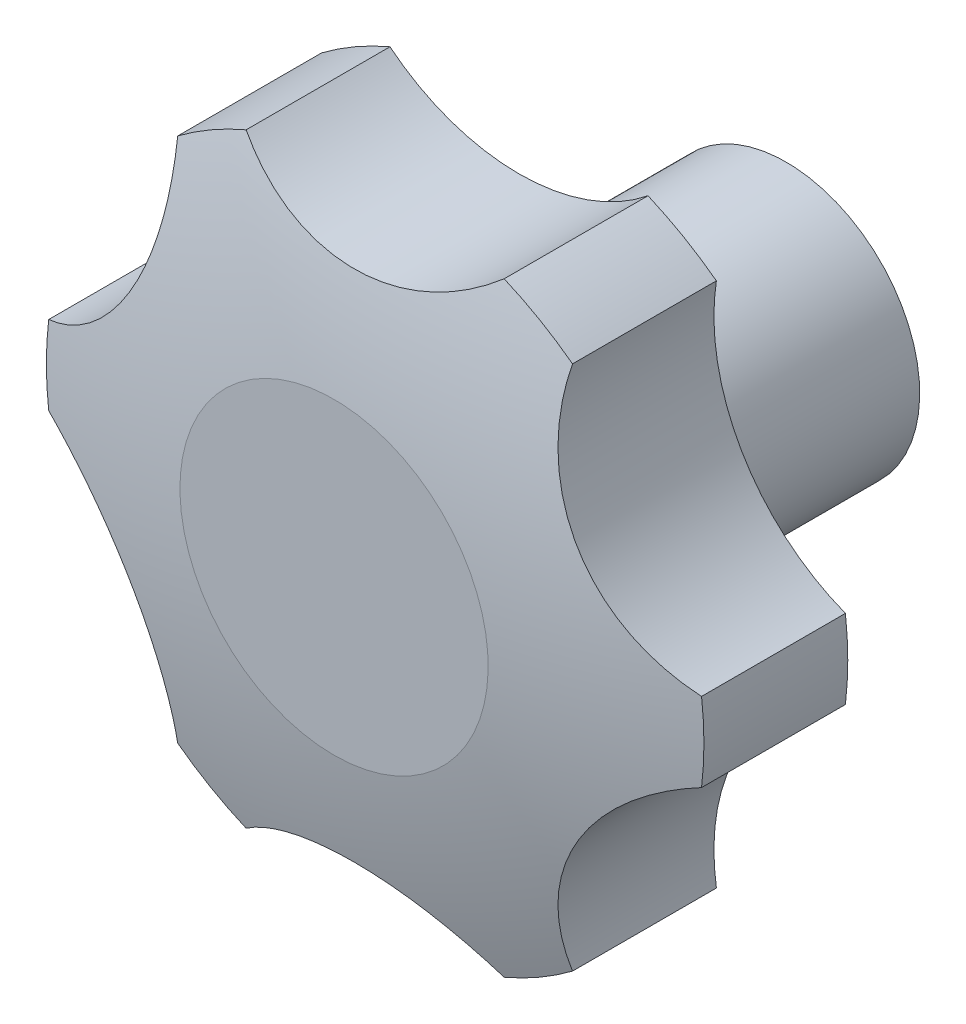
ISO-10303-21;
HEADER;
FILE_DESCRIPTION(('STEP AP214'),'2;1');
FILE_NAME('part.step','',(''),(''),'','','');
FILE_SCHEMA(('AUTOMOTIVE_DESIGN { 1 0 10303 214 1 1 1 1 }'));
ENDSEC;
DATA;
#1=APPLICATION_CONTEXT('core data for automotive mechanical design processes');
#2=APPLICATION_PROTOCOL_DEFINITION('international standard','automotive_design',2000,#1);
#3=PRODUCT_CONTEXT('',#1,'mechanical');
#4=PRODUCT('Part','Part','',(#3));
#5=PRODUCT_RELATED_PRODUCT_CATEGORY('part','',(#4));
#6=PRODUCT_DEFINITION_FORMATION('','',#4);
#7=PRODUCT_DEFINITION_CONTEXT('part definition',#1,'design');
#8=PRODUCT_DEFINITION('design','',#6,#7);
#9=PRODUCT_DEFINITION_SHAPE('','',#8);
#10=(LENGTH_UNIT() NAMED_UNIT(*) SI_UNIT(.MILLI.,.METRE.));
#11=(NAMED_UNIT(*) PLANE_ANGLE_UNIT() SI_UNIT($,.RADIAN.));
#12=(NAMED_UNIT(*) SI_UNIT($,.STERADIAN.) SOLID_ANGLE_UNIT());
#13=UNCERTAINTY_MEASURE_WITH_UNIT(LENGTH_MEASURE(1.E-05),#10,'distance_accuracy_value','');
#14=(GEOMETRIC_REPRESENTATION_CONTEXT(3) GLOBAL_UNCERTAINTY_ASSIGNED_CONTEXT((#13)) GLOBAL_UNIT_ASSIGNED_CONTEXT((#10,
#11,#12)) REPRESENTATION_CONTEXT('',''));
#15=CARTESIAN_POINT('',(0.,0.,0.));
#16=DIRECTION('',(0.,0.,1.));
#17=DIRECTION('',(1.,0.,0.));
#18=AXIS2_PLACEMENT_3D('',#15,#16,#17);
#19=CARTESIAN_POINT('',(0.,0.,30.));
#20=DIRECTION('',(0.,0.,1.));
#21=DIRECTION('',(0.,-1.,0.));
#22=AXIS2_PLACEMENT_3D('',#19,#20,#21);
#23=CYLINDRICAL_SURFACE('',#22,16.);
#24=DIRECTION('',(0.,0.,1.));
#25=VECTOR('',#24,1.);
#26=CARTESIAN_POINT('',(15.8842635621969,-1.92098180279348,16.5));
#27=LINE('',#26,#25);
#28=CARTESIAN_POINT('',(15.8842635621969,-1.92098180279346,13.));
#29=VERTEX_POINT('',#28);
#30=CARTESIAN_POINT('',(15.884263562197,-1.92098180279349,20.));
#31=VERTEX_POINT('',#30);
#32=EDGE_CURVE('E35',#29,#31,#27,.T.);
#33=ORIENTED_EDGE('',*,*,#32,.F.);
#34=CARTESIAN_POINT('',(0.,0.,13.));
#35=DIRECTION('',(0.,0.,1.));
#36=DIRECTION('',(0.,-1.,0.));
#37=AXIS2_PLACEMENT_3D('',#34,#35,#36);
#38=CIRCLE('',#37,16.);
#39=CARTESIAN_POINT('',(15.884263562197,1.92098180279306,13.));
#40=VERTEX_POINT('',#39);
#41=EDGE_CURVE('E120',#29,#40,#38,.T.);
#42=ORIENTED_EDGE('',*,*,#41,.T.);
#43=DIRECTION('',(0.,0.,1.));
#44=VECTOR('',#43,1.);
#45=CARTESIAN_POINT('',(15.884263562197,1.92098180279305,17.5));
#46=LINE('',#45,#44);
#47=CARTESIAN_POINT('',(15.884263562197,1.92098180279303,20.));
#48=VERTEX_POINT('',#47);
#49=EDGE_CURVE('E261',#48,#40,#46,.F.);
#50=ORIENTED_EDGE('',*,*,#49,.F.);
#51=CARTESIAN_POINT('',(0.,0.,20.));
#52=DIRECTION('',(0.,0.,1.));
#53=DIRECTION('',(0.,-1.,0.));
#54=AXIS2_PLACEMENT_3D('',#51,#52,#53);
#55=CIRCLE('',#54,16.);
#56=EDGE_CURVE('E122',#31,#48,#55,.T.);
#57=ORIENTED_EDGE('',*,*,#56,.F.);
#58=EDGE_LOOP('',(#33,#42,#50,#57));
#59=FACE_BOUND('',#58,.T.);
#60=ADVANCED_FACE('F14',(#59),#23,.T.);
#61=DIRECTION('',(0.,0.,1.));
#62=VECTOR('',#61,1.);
#63=CARTESIAN_POINT('',(9.60575082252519,12.7956848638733,17.5));
#64=LINE('',#63,#62);
#65=CARTESIAN_POINT('',(9.60575082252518,12.7956848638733,13.));
#66=VERTEX_POINT('',#65);
#67=CARTESIAN_POINT('',(9.60575082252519,12.7956848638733,20.));
#68=VERTEX_POINT('',#67);
#69=EDGE_CURVE('E42',#66,#68,#64,.T.);
#70=ORIENTED_EDGE('',*,*,#69,.F.);
#71=CARTESIAN_POINT('',(6.27851273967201,14.7166666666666,13.));
#72=VERTEX_POINT('',#71);
#73=EDGE_CURVE('E130',#66,#72,#38,.T.);
#74=ORIENTED_EDGE('',*,*,#73,.T.);
#75=DIRECTION('',(0.,0.,1.));
#76=VECTOR('',#75,1.);
#77=CARTESIAN_POINT('',(6.27851273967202,14.7166666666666,17.5));
#78=LINE('',#77,#76);
#79=CARTESIAN_POINT('',(6.27851273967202,14.7166666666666,20.));
#80=VERTEX_POINT('',#79);
#81=EDGE_CURVE('E254',#80,#72,#78,.F.);
#82=ORIENTED_EDGE('',*,*,#81,.F.);
#83=EDGE_CURVE('E229',#68,#80,#55,.T.);
#84=ORIENTED_EDGE('',*,*,#83,.F.);
#85=EDGE_LOOP('',(#70,#74,#82,#84));
#86=FACE_BOUND('',#85,.T.);
#87=ADVANCED_FACE('F182',(#86),#23,.T.);
#88=DIRECTION('',(0.,0.,1.));
#89=VECTOR('',#88,1.);
#90=CARTESIAN_POINT('',(-6.27851273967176,14.7166666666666,17.5));
#91=LINE('',#90,#89);
#92=CARTESIAN_POINT('',(-6.27851273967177,14.7166666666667,13.));
#93=VERTEX_POINT('',#92);
#94=CARTESIAN_POINT('',(-6.27851273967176,14.7166666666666,20.));
#95=VERTEX_POINT('',#94);
#96=EDGE_CURVE('E252',#93,#95,#91,.T.);
#97=ORIENTED_EDGE('',*,*,#96,.F.);
#98=CARTESIAN_POINT('',(-9.60575082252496,12.7956848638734,13.));
#99=VERTEX_POINT('',#98);
#100=EDGE_CURVE('E134',#93,#99,#38,.T.);
#101=ORIENTED_EDGE('',*,*,#100,.T.);
#102=DIRECTION('',(0.,0.,1.));
#103=VECTOR('',#102,1.);
#104=CARTESIAN_POINT('',(-9.60575082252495,12.7956848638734,17.5));
#105=LINE('',#104,#103);
#106=CARTESIAN_POINT('',(-9.60575082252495,12.7956848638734,20.));
#107=VERTEX_POINT('',#106);
#108=EDGE_CURVE('E246',#107,#99,#105,.F.);
#109=ORIENTED_EDGE('',*,*,#108,.F.);
#110=EDGE_CURVE('E233',#95,#107,#55,.T.);
#111=ORIENTED_EDGE('',*,*,#110,.F.);
#112=EDGE_LOOP('',(#97,#101,#109,#111));
#113=FACE_BOUND('',#112,.T.);
#114=ADVANCED_FACE('F187',(#113),#23,.T.);
#115=DIRECTION('',(0.,0.,1.));
#116=VECTOR('',#115,1.);
#117=CARTESIAN_POINT('',(-15.8842635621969,1.92098180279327,17.5));
#118=LINE('',#117,#116);
#119=CARTESIAN_POINT('',(-15.884263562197,1.92098180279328,13.));
#120=VERTEX_POINT('',#119);
#121=CARTESIAN_POINT('',(-15.8842635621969,1.92098180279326,20.));
#122=VERTEX_POINT('',#121);
#123=EDGE_CURVE('E244',#120,#122,#118,.T.);
#124=ORIENTED_EDGE('',*,*,#123,.F.);
#125=CARTESIAN_POINT('',(-15.884263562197,-1.92098180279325,13.));
#126=VERTEX_POINT('',#125);
#127=EDGE_CURVE('E225',#120,#126,#38,.T.);
#128=ORIENTED_EDGE('',*,*,#127,.T.);
#129=DIRECTION('',(0.,0.,1.));
#130=VECTOR('',#129,1.);
#131=CARTESIAN_POINT('',(-15.884263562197,-1.92098180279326,16.5));
#132=LINE('',#131,#130);
#133=CARTESIAN_POINT('',(-15.8842635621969,-1.92098180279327,20.));
#134=VERTEX_POINT('',#133);
#135=EDGE_CURVE('E219',#134,#126,#132,.F.);
#136=ORIENTED_EDGE('',*,*,#135,.F.);
#137=EDGE_CURVE('E230',#122,#134,#55,.T.);
#138=ORIENTED_EDGE('',*,*,#137,.F.);
#139=EDGE_LOOP('',(#124,#128,#136,#138));
#140=FACE_BOUND('',#139,.T.);
#141=ADVANCED_FACE('F199',(#140),#23,.T.);
#142=DIRECTION('',(0.,0.,1.));
#143=VECTOR('',#142,1.);
#144=CARTESIAN_POINT('',(-9.60575082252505,-12.7956848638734,16.5));
#145=LINE('',#144,#143);
#146=CARTESIAN_POINT('',(-9.60575082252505,-12.7956848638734,13.));
#147=VERTEX_POINT('',#146);
#148=CARTESIAN_POINT('',(-9.60575082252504,-12.7956848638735,20.));
#149=VERTEX_POINT('',#148);
#150=EDGE_CURVE('E210',#147,#149,#145,.T.);
#151=ORIENTED_EDGE('',*,*,#150,.F.);
#152=CARTESIAN_POINT('',(-6.27851273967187,-14.7166666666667,13.));
#153=VERTEX_POINT('',#152);
#154=EDGE_CURVE('E133',#147,#153,#38,.T.);
#155=ORIENTED_EDGE('',*,*,#154,.T.);
#156=DIRECTION('',(0.,0.,1.));
#157=VECTOR('',#156,1.);
#158=CARTESIAN_POINT('',(-6.27851273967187,-14.7166666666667,16.5));
#159=LINE('',#158,#157);
#160=CARTESIAN_POINT('',(-6.27851273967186,-14.7166666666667,20.));
#161=VERTEX_POINT('',#160);
#162=EDGE_CURVE('E236',#161,#153,#159,.F.);
#163=ORIENTED_EDGE('',*,*,#162,.F.);
#164=EDGE_CURVE('E214',#149,#161,#55,.T.);
#165=ORIENTED_EDGE('',*,*,#164,.F.);
#166=EDGE_LOOP('',(#151,#155,#163,#165));
#167=FACE_BOUND('',#166,.T.);
#168=ADVANCED_FACE('F192',(#167),#23,.T.);
#169=CARTESIAN_POINT('',(0.,0.,0.));
#170=DIRECTION('',(0.,0.,1.));
#171=DIRECTION('',(0.,-1.,0.));
#172=AXIS2_PLACEMENT_3D('',#169,#170,#171);
#173=PLANE('',#172);
#174=CARTESIAN_POINT('',(0.,0.,0.));
#175=DIRECTION('',(0.,0.,-1.));
#176=DIRECTION('',(0.,1.,0.));
#177=AXIS2_PLACEMENT_3D('',#174,#175,#176);
#178=CIRCLE('',#177,2.5);
#179=CARTESIAN_POINT('',(0.,2.5,0.));
#180=VERTEX_POINT('',#179);
#181=EDGE_CURVE('E115',#180,#180,#178,.T.);
#182=ORIENTED_EDGE('',*,*,#181,.F.);
#183=EDGE_LOOP('',(#182));
#184=FACE_BOUND('',#183,.T.);
#185=CARTESIAN_POINT('',(0.,0.,0.));
#186=DIRECTION('',(0.,0.,1.));
#187=DIRECTION('',(0.,-1.,0.));
#188=AXIS2_PLACEMENT_3D('',#185,#186,#187);
#189=CIRCLE('',#188,6.5);
#190=CARTESIAN_POINT('',(0.,-6.5,0.));
#191=VERTEX_POINT('',#190);
#192=EDGE_CURVE('E141',#191,#191,#189,.T.);
#193=ORIENTED_EDGE('',*,*,#192,.F.);
#194=EDGE_LOOP('',(#193));
#195=FACE_BOUND('',#194,.T.);
#196=ADVANCED_FACE('F16',(#184,#195),#173,.F.);
#197=CARTESIAN_POINT('',(0.,0.,30.));
#198=DIRECTION('',(0.,0.,1.));
#199=DIRECTION('',(0.,-1.,0.));
#200=AXIS2_PLACEMENT_3D('',#197,#198,#199);
#201=CYLINDRICAL_SURFACE('',#200,6.5);
#202=CARTESIAN_POINT('',(0.,0.,13.));
#203=DIRECTION('',(0.,0.,1.));
#204=DIRECTION('',(0.,-1.,0.));
#205=AXIS2_PLACEMENT_3D('',#202,#203,#204);
#206=CIRCLE('',#205,6.5);
#207=CARTESIAN_POINT('',(0.,-6.50000000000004,13.));
#208=VERTEX_POINT('',#207);
#209=EDGE_CURVE('E132',#208,#208,#206,.T.);
#210=ORIENTED_EDGE('',*,*,#209,.F.);
#211=EDGE_LOOP('',(#210));
#212=FACE_BOUND('',#211,.T.);
#213=ORIENTED_EDGE('',*,*,#192,.T.);
#214=EDGE_LOOP('',(#213));
#215=FACE_BOUND('',#214,.T.);
#216=ADVANCED_FACE('F197',(#212,#215),#201,.T.);
#217=CARTESIAN_POINT('',(6.5,0.,13.));
#218=DIRECTION('',(0.,0.,1.));
#219=DIRECTION('',(0.,-1.,0.));
#220=AXIS2_PLACEMENT_3D('',#217,#218,#219);
#221=PLANE('',#220);
#222=ORIENTED_EDGE('',*,*,#41,.F.);
#223=CARTESIAN_POINT('',(19.4855715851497,-11.2500000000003,13.));
#224=DIRECTION('',(0.,0.,1.));
#225=DIRECTION('',(0.866025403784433,-0.50000000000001,0.));
#226=AXIS2_PLACEMENT_3D('',#223,#224,#225);
#227=CIRCLE('',#226,10.);
#228=CARTESIAN_POINT('',(9.60575082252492,-12.7956848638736,13.));
#229=VERTEX_POINT('',#228);
#230=EDGE_CURVE('E107',#29,#229,#227,.T.);
#231=ORIENTED_EDGE('',*,*,#230,.T.);
#232=CARTESIAN_POINT('',(6.27851273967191,-14.7166666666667,13.));
#233=VERTEX_POINT('',#232);
#234=EDGE_CURVE('E129',#233,#229,#38,.T.);
#235=ORIENTED_EDGE('',*,*,#234,.F.);
#236=CARTESIAN_POINT('',(0.,-22.5,13.));
#237=DIRECTION('',(0.,0.,1.));
#238=DIRECTION('',(0.,-1.,0.));
#239=AXIS2_PLACEMENT_3D('',#236,#237,#238);
#240=CIRCLE('',#239,10.);
#241=EDGE_CURVE('E218',#233,#153,#240,.T.);
#242=ORIENTED_EDGE('',*,*,#241,.T.);
#243=ORIENTED_EDGE('',*,*,#154,.F.);
#244=CARTESIAN_POINT('',(-19.4855715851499,-11.25,13.));
#245=DIRECTION('',(0.,0.,1.));
#246=DIRECTION('',(-0.86602540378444,-0.5,0.));
#247=AXIS2_PLACEMENT_3D('',#244,#245,#246);
#248=CIRCLE('',#247,10.);
#249=EDGE_CURVE('E224',#147,#126,#248,.T.);
#250=ORIENTED_EDGE('',*,*,#249,.T.);
#251=ORIENTED_EDGE('',*,*,#127,.F.);
#252=CARTESIAN_POINT('',(-19.4855715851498,11.25,13.));
#253=DIRECTION('',(0.,0.,1.));
#254=DIRECTION('',(-0.866025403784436,0.5,0.));
#255=AXIS2_PLACEMENT_3D('',#252,#253,#254);
#256=CIRCLE('',#255,10.);
#257=EDGE_CURVE('E249',#120,#99,#256,.T.);
#258=ORIENTED_EDGE('',*,*,#257,.T.);
#259=ORIENTED_EDGE('',*,*,#100,.F.);
#260=CARTESIAN_POINT('',(1.76446527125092E-13,22.5,13.));
#261=DIRECTION('',(0.,0.,1.));
#262=DIRECTION('',(0.,1.,0.));
#263=AXIS2_PLACEMENT_3D('',#260,#261,#262);
#264=CIRCLE('',#263,10.);
#265=EDGE_CURVE('E257',#93,#72,#264,.T.);
#266=ORIENTED_EDGE('',*,*,#265,.T.);
#267=ORIENTED_EDGE('',*,*,#73,.F.);
#268=CARTESIAN_POINT('',(19.48557158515,11.2499999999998,13.));
#269=DIRECTION('',(0.,0.,1.));
#270=DIRECTION('',(0.866025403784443,0.499999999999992,0.));
#271=AXIS2_PLACEMENT_3D('',#268,#269,#270);
#272=CIRCLE('',#271,10.);
#273=EDGE_CURVE('E123',#66,#40,#272,.T.);
#274=ORIENTED_EDGE('',*,*,#273,.T.);
#275=EDGE_LOOP('',(#222,#231,#235,#242,#243,#250,#251,#258,#259,#266,#267,#274));
#276=FACE_BOUND('',#275,.T.);
#277=ORIENTED_EDGE('',*,*,#209,.T.);
#278=EDGE_LOOP('',(#277));
#279=FACE_BOUND('',#278,.T.);
#280=ADVANCED_FACE('F126',(#276,#279),#221,.F.);
#281=DIRECTION('',(0.,0.,1.));
#282=VECTOR('',#281,1.);
#283=CARTESIAN_POINT('',(9.60575082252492,-12.7956848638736,16.5));
#284=LINE('',#283,#282);
#285=CARTESIAN_POINT('',(9.60575082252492,-12.7956848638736,20.));
#286=VERTEX_POINT('',#285);
#287=EDGE_CURVE('E110',#286,#229,#284,.F.);
#288=ORIENTED_EDGE('',*,*,#287,.F.);
#289=CARTESIAN_POINT('',(6.27851273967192,-14.7166666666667,20.));
#290=VERTEX_POINT('',#289);
#291=EDGE_CURVE('E137',#290,#286,#55,.T.);
#292=ORIENTED_EDGE('',*,*,#291,.F.);
#293=DIRECTION('',(0.,0.,1.));
#294=VECTOR('',#293,1.);
#295=CARTESIAN_POINT('',(6.27851273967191,-14.7166666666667,16.5));
#296=LINE('',#295,#294);
#297=EDGE_CURVE('E234',#233,#290,#296,.T.);
#298=ORIENTED_EDGE('',*,*,#297,.F.);
#299=ORIENTED_EDGE('',*,*,#234,.T.);
#300=EDGE_LOOP('',(#288,#292,#298,#299));
#301=FACE_BOUND('',#300,.T.);
#302=ADVANCED_FACE('F178',(#301),#23,.T.);
#303=CARTESIAN_POINT('',(0.,0.,-27.4849456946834));
#304=DIRECTION('',(0.,0.,1.));
#305=DIRECTION('',(0.,-1.,0.));
#306=AXIS2_PLACEMENT_3D('',#303,#304,#305);
#307=DEGENERATE_TOROIDAL_SURFACE('',#306,0.341777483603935,50.,.T.);
#308=CARTESIAN_POINT('',(0.,0.,22.));
#309=DIRECTION('',(0.,0.,1.));
#310=DIRECTION('',(0.,-1.,0.));
#311=AXIS2_PLACEMENT_3D('',#308,#309,#310);
#312=CIRCLE('',#311,7.5);
#313=CARTESIAN_POINT('',(0.,-7.50000000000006,22.));
#314=VERTEX_POINT('',#313);
#315=EDGE_CURVE('E231',#314,#314,#312,.T.);
#316=ORIENTED_EDGE('',*,*,#315,.F.);
#317=EDGE_LOOP('',(#316));
#318=FACE_BOUND('',#317,.T.);
#319=ORIENTED_EDGE('',*,*,#291,.T.);
#320=CARTESIAN_POINT('',(9.60585702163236,-12.7963635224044,19.9998));
#321=CARTESIAN_POINT('',(9.56548180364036,-12.5386008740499,20.0757787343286));
#322=CARTESIAN_POINT('',(9.5350850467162,-12.2781732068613,20.148149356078));
#323=CARTESIAN_POINT('',(9.4948060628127,-11.7536447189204,20.2851827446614));
#324=CARTESIAN_POINT('',(9.48493039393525,-11.4895427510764,20.3498430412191));
#325=CARTESIAN_POINT('',(9.48627863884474,-10.9591277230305,20.4709975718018));
#326=CARTESIAN_POINT('',(9.49753137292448,-10.692812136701,20.527480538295));
#327=CARTESIAN_POINT('',(9.541535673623,-10.1602691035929,20.6317026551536));
#328=CARTESIAN_POINT('',(9.57428471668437,-9.89404165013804,20.679442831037));
#329=CARTESIAN_POINT('',(9.66153095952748,-9.36298916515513,20.7658807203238));
#330=CARTESIAN_POINT('',(9.71608145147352,-9.09816919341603,20.8045559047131));
#331=CARTESIAN_POINT('',(9.84683229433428,-8.57268692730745,20.872363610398));
#332=CARTESIAN_POINT('',(9.92303181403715,-8.31202447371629,20.9014964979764));
#333=CARTESIAN_POINT('',(10.0966315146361,-7.79724693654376,20.9499256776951));
#334=CARTESIAN_POINT('',(10.1940075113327,-7.54312475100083,20.9692331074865));
#335=CARTESIAN_POINT('',(10.4093957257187,-7.04320797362,20.9978797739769));
#336=CARTESIAN_POINT('',(10.5274068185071,-6.797412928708,21.0072195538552));
#337=CARTESIAN_POINT('',(10.7771406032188,-6.32753721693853,21.0156412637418));
#338=CARTESIAN_POINT('',(10.9079511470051,-6.10297934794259,21.0151873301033));
#339=CARTESIAN_POINT('',(11.1865506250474,-5.66487384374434,21.0051588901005));
#340=CARTESIAN_POINT('',(11.3343391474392,-5.45132594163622,20.9955846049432));
#341=CARTESIAN_POINT('',(11.6458323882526,-5.03664566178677,20.9673905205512));
#342=CARTESIAN_POINT('',(11.8095449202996,-4.83551945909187,20.9487662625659));
#343=CARTESIAN_POINT('',(12.1515259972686,-4.44715361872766,20.9026287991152));
#344=CARTESIAN_POINT('',(12.3297942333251,-4.25991368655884,20.8751157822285));
#345=CARTESIAN_POINT('',(12.6979218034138,-3.90199563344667,20.8116973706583));
#346=CARTESIAN_POINT('',(12.8876717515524,-3.73119211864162,20.7758640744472));
#347=CARTESIAN_POINT('',(13.2786279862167,-3.40534522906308,20.69596872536));
#348=CARTESIAN_POINT('',(13.479834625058,-3.25030233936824,20.6519064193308));
#349=CARTESIAN_POINT('',(13.8919801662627,-2.95689000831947,20.5559422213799));
#350=CARTESIAN_POINT('',(14.1029099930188,-2.81850543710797,20.5040475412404));
#351=CARTESIAN_POINT('',(14.5330691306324,-2.55886672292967,20.3927920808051));
#352=CARTESIAN_POINT('',(14.7522951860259,-2.43760594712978,20.3334342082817));
#353=CARTESIAN_POINT('',(15.1239675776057,-2.24976008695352,20.2284555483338));
#354=CARTESIAN_POINT('',(15.2745473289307,-2.17834715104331,20.1847754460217));
#355=CARTESIAN_POINT('',(15.5780261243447,-2.04355596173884,20.0944745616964));
#356=CARTESIAN_POINT('',(15.7309201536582,-1.98016252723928,20.0478595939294));
#357=CARTESIAN_POINT('',(15.8849043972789,-1.92073444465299,19.9998));
#358=B_SPLINE_CURVE_WITH_KNOTS('',3,(#320,#321,#322,#323,#324,#325,#326,#327,#328,#329,#330,
#331,#332,#333,#334,#335,#336,#337,#338,#339,#340,#341,#342,#343,#344,#345,#346,#347,#348,#349,
#350,#351,#352,#353,#354,#355,#356,#357),.UNSPECIFIED.,.F.,.F.,(4,2,2,2,2,2,2,2,2,2,2,2,2,2,2,2,
2,2,4),(0.,0.815067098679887,1.63039463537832,2.44683513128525,3.26317979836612,
4.08153229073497,4.8998533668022,5.71724475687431,6.53459160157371,7.31329225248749,
8.09197401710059,8.87103981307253,9.65008908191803,10.4226241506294,11.1951829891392,
11.9670347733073,12.7385867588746,13.2552280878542,13.7708762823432),.UNSPECIFIED.);
#359=EDGE_CURVE('E9',#286,#31,#358,.T.);
#360=ORIENTED_EDGE('',*,*,#359,.T.);
#361=ORIENTED_EDGE('',*,*,#56,.T.);
#362=CARTESIAN_POINT('',(15.8849043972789,1.92073444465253,19.9998));
#363=CARTESIAN_POINT('',(15.6414877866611,2.01464980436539,20.0757787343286));
#364=CARTESIAN_POINT('',(15.4007524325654,2.11853927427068,20.148149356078));
#365=CARTESIAN_POINT('',(14.9263579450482,2.34592089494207,20.2851827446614));
#366=CARTESIAN_POINT('',(14.6927010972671,2.46941929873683,20.3498430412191));
#367=CARTESIAN_POINT('',(14.234022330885,2.73579442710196,20.4709975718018));
#368=CARTESIAN_POINT('',(14.0090126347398,2.8786973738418,20.527480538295));
#369=CARTESIAN_POINT('',(13.5698189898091,3.1830777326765,20.6317026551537));
#370=CARTESIAN_POINT('',(13.355633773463,3.34455296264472,20.679442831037));
#371=CARTESIAN_POINT('',(12.9393519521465,3.68563666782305,20.7658807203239));
#372=CARTESIAN_POINT('',(12.737286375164,3.86528876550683,20.8045559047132));
#373=CARTESIAN_POINT('',(12.3475808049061,4.24126345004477,20.872363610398));
#374=CARTESIAN_POINT('',(12.1599402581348,4.4375853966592,20.9014964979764));
#375=CARTESIAN_POINT('',(11.8009296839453,4.84531591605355,20.9499256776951));
#376=CARTESIAN_POINT('',(11.6295414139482,5.05670709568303,20.9692331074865));
#377=CARTESIAN_POINT('',(11.3042948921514,5.49319714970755,20.997879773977));
#378=CARTESIAN_POINT('',(11.1504356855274,5.71829527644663,21.0072195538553));
#379=CARTESIAN_POINT('',(10.8683782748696,6.16950893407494,21.0156412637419));
#380=CARTESIAN_POINT('',(10.7393107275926,6.39507312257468,21.0151873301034));
#381=CARTESIAN_POINT('',(10.4991999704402,6.85540010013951,21.0051588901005));
#382=CARTESIAN_POINT('',(10.3881563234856,7.09016266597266,20.9955846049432));
#383=CARTESIAN_POINT('',(10.1847792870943,7.56726386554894,20.9673905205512));
#384=CARTESIAN_POINT('',(10.0924551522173,7.80960617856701,20.948766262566));
#385=CARTESIAN_POINT('',(9.92711100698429,8.29995339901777,20.9026287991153));
#386=CARTESIAN_POINT('',(9.85409058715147,8.54795818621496,20.8751157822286));
#387=CARTESIAN_POINT('',(9.72818824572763,9.04572504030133,20.8116973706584));
#388=CARTESIAN_POINT('',(9.67514303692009,9.29545507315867,20.7758640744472));
#389=CARTESIAN_POINT('',(9.58842947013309,9.79695654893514,20.6959687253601));
#390=CARTESIAN_POINT('',(9.55476170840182,10.0487280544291,20.6519064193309));
#391=CARTESIAN_POINT('',(9.50673194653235,10.5523627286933,20.5559422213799));
#392=CARTESIAN_POINT('',(9.4923523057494,10.8042256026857,20.5040475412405));
#393=CARTESIAN_POINT('',(9.48257815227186,11.3065737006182,20.3927920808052));
#394=CARTESIAN_POINT('',(9.48717626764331,11.5570594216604,20.3334342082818));
#395=CARTESIAN_POINT('',(9.51033317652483,11.972860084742,20.2284555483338));
#396=CARTESIAN_POINT('',(9.52377763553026,12.1389724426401,20.1847754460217));
#397=CARTESIAN_POINT('',(9.5587844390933,12.4691883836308,20.0944745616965));
#398=CARTESIAN_POINT('',(9.58033112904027,12.633295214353,20.0478595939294));
#399=CARTESIAN_POINT('',(9.60585702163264,12.7963635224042,19.9998));
#400=B_SPLINE_CURVE_WITH_KNOTS('',3,(#362,#363,#364,#365,#366,#367,#368,#369,#370,#371,#372,
#373,#374,#375,#376,#377,#378,#379,#380,#381,#382,#383,#384,#385,#386,#387,#388,#389,#390,#391,
#392,#393,#394,#395,#396,#397,#398,#399),.UNSPECIFIED.,.F.,.F.,(4,2,2,2,2,2,2,2,2,2,2,2,2,2,2,2,
2,2,4),(0.,0.815067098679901,1.63039463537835,2.44683513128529,3.26317979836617,
4.08153229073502,4.89985336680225,5.71724475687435,6.53459160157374,7.31329225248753,
8.09197401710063,8.87103981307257,9.65008908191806,10.4226241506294,11.1951829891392,
11.9670347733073,12.7385867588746,13.2552280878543,13.7708762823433),.UNSPECIFIED.);
#401=EDGE_CURVE('E28',#48,#68,#400,.T.);
#402=ORIENTED_EDGE('',*,*,#401,.T.);
#403=ORIENTED_EDGE('',*,*,#83,.T.);
#404=CARTESIAN_POINT('',(6.27904737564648,14.7170979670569,19.9998));
#405=CARTESIAN_POINT('',(6.07600598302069,14.5532506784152,20.0757787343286));
#406=CARTESIAN_POINT('',(5.86566738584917,14.396712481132,20.1481493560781));
#407=CARTESIAN_POINT('',(5.43155188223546,14.0995656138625,20.2851827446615));
#408=CARTESIAN_POINT('',(5.20777070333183,13.9589620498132,20.3498430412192));
#409=CARTESIAN_POINT('',(4.74774369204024,13.6949221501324,20.4709975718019));
#410=CARTESIAN_POINT('',(4.51148126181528,13.5715095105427,20.5274805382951));
#411=CARTESIAN_POINT('',(4.02828331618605,13.3433468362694,20.6317026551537));
#412=CARTESIAN_POINT('',(3.78134905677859,13.2385946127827,20.6794428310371));
#413=CARTESIAN_POINT('',(3.27782099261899,13.0486258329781,20.7658807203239));
#414=CARTESIAN_POINT('',(3.02120492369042,12.9634579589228,20.8045559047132));
#415=CARTESIAN_POINT('',(2.50074851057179,12.8139503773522,20.872363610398));
#416=CARTESIAN_POINT('',(2.23690844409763,12.7496098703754,20.9014964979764));
#417=CARTESIAN_POINT('',(1.70429816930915,12.6425628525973,20.9499256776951));
#418=CARTESIAN_POINT('',(1.43553390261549,12.5998318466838,20.9692331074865));
#419=CARTESIAN_POINT('',(0.894899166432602,12.5364051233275,20.997879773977));
#420=CARTESIAN_POINT('',(0.6230288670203,12.5157082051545,21.0072195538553));
#421=CARTESIAN_POINT('',(0.091237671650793,12.4970461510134,21.0156412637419));
#422=CARTESIAN_POINT('',(-0.168640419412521,12.4980524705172,21.0151873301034));
#423=CARTESIAN_POINT('',(-0.68735065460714,12.5202739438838,21.0051588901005));
#424=CARTESIAN_POINT('',(-0.946182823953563,12.5414886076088,20.9955846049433));
#425=CARTESIAN_POINT('',(-1.46105310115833,12.6039095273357,20.9673905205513));
#426=CARTESIAN_POINT('',(-1.71708976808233,12.6451256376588,20.948766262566));
#427=CARTESIAN_POINT('',(-2.2244149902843,12.7471070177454,20.9026287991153));
#428=CARTESIAN_POINT('',(-2.47570364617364,12.8078718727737,20.8751157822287));
#429=CARTESIAN_POINT('',(-2.96973355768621,12.9477206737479,20.8116973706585));
#430=CARTESIAN_POINT('',(-3.21252871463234,13.0266471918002,20.7758640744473));
#431=CARTESIAN_POINT('',(-3.69019851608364,13.2023017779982,20.6959687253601));
#432=CARTESIAN_POINT('',(-3.92507291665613,13.2990303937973,20.6519064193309));
#433=CARTESIAN_POINT('',(-4.38524821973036,13.5092527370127,20.55594222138));
#434=CARTESIAN_POINT('',(-4.61055768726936,13.6227310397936,20.5040475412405));
#435=CARTESIAN_POINT('',(-5.05049097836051,13.8654404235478,20.3927920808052));
#436=CARTESIAN_POINT('',(-5.26511891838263,13.9946653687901,20.3334342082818));
#437=CARTESIAN_POINT('',(-5.61363440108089,14.2226201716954,20.2284555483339));
#438=CARTESIAN_POINT('',(-5.75076969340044,14.3173195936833,20.1847754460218));
#439=CARTESIAN_POINT('',(-6.01924168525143,14.5127443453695,20.0944745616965));
#440=CARTESIAN_POINT('',(-6.15058902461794,14.6134577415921,20.0478595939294));
#441=CARTESIAN_POINT('',(-6.27904737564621,14.7170979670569,19.9998));
#442=B_SPLINE_CURVE_WITH_KNOTS('',3,(#404,#405,#406,#407,#408,#409,#410,#411,#412,#413,#414,
#415,#416,#417,#418,#419,#420,#421,#422,#423,#424,#425,#426,#427,#428,#429,#430,#431,#432,#433,
#434,#435,#436,#437,#438,#439,#440,#441),.UNSPECIFIED.,.F.,.F.,(4,2,2,2,2,2,2,2,2,2,2,2,2,2,2,2,
2,2,4),(0.,0.815067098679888,1.63039463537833,2.44683513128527,3.26317979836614,
4.08153229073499,4.89985336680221,5.71724475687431,6.53459160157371,7.31329225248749,
8.09197401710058,8.87103981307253,9.65008908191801,10.4226241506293,11.1951829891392,
11.9670347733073,12.7385867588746,13.2552280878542,13.7708762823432),.UNSPECIFIED.);
#443=EDGE_CURVE('E296',#80,#95,#442,.T.);
#444=ORIENTED_EDGE('',*,*,#443,.T.);
#445=ORIENTED_EDGE('',*,*,#110,.T.);
#446=CARTESIAN_POINT('',(-9.60585702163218,12.7963635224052,19.9997999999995));
#447=CARTESIAN_POINT('',(-9.5654818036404,12.5386008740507,20.0757787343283));
#448=CARTESIAN_POINT('',(-9.53508504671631,12.2781732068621,20.1481493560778));
#449=CARTESIAN_POINT('',(-9.49480606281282,11.7536447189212,20.2851827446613));
#450=CARTESIAN_POINT('',(-9.48493039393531,11.4895427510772,20.349843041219));
#451=CARTESIAN_POINT('',(-9.48627863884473,10.9591277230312,20.4709975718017));
#452=CARTESIAN_POINT('',(-9.49753137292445,10.6928121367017,20.5274805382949));
#453=CARTESIAN_POINT('',(-9.54153567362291,10.1602691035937,20.6317026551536));
#454=CARTESIAN_POINT('',(-9.57428471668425,9.89404165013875,20.6794428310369));
#455=CARTESIAN_POINT('',(-9.66153095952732,9.36298916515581,20.7658807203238));
#456=CARTESIAN_POINT('',(-9.71608145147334,9.09816919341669,20.8045559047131));
#457=CARTESIAN_POINT('',(-9.84683229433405,8.57268692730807,20.8723636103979));
#458=CARTESIAN_POINT('',(-9.9230318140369,8.31202447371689,20.9014964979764));
#459=CARTESIAN_POINT('',(-10.0966315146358,7.79724693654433,20.9499256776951));
#460=CARTESIAN_POINT('',(-10.1940075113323,7.54312475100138,20.9692331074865));
#461=CARTESIAN_POINT('',(-10.4093957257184,7.04320797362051,20.997879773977));
#462=CARTESIAN_POINT('',(-10.5274068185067,6.7974129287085,21.0072195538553));
#463=CARTESIAN_POINT('',(-10.7771406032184,6.32753721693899,21.0156412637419));
#464=CARTESIAN_POINT('',(-10.9079511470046,6.10297934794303,21.0151873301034));
#465=CARTESIAN_POINT('',(-11.1865506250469,5.66487384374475,21.0051588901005));
#466=CARTESIAN_POINT('',(-11.3343391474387,5.45132594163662,20.9955846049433));
#467=CARTESIAN_POINT('',(-11.6458323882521,5.03664566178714,20.9673905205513));
#468=CARTESIAN_POINT('',(-11.8095449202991,4.83551945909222,20.9487662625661));
#469=CARTESIAN_POINT('',(-12.151525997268,4.44715361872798,20.9026287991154));
#470=CARTESIAN_POINT('',(-12.3297942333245,4.25991368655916,20.8751157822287));
#471=CARTESIAN_POINT('',(-12.6979218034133,3.90199563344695,20.8116973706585));
#472=CARTESIAN_POINT('',(-12.8876717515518,3.73119211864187,20.7758640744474));
#473=CARTESIAN_POINT('',(-13.2786279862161,3.40534522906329,20.6959687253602));
#474=CARTESIAN_POINT('',(-13.4798346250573,3.25030233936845,20.651906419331));
#475=CARTESIAN_POINT('',(-13.891980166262,2.95689000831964,20.5559422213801));
#476=CARTESIAN_POINT('',(-14.1029099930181,2.81850543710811,20.5040475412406));
#477=CARTESIAN_POINT('',(-14.5330691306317,2.55886672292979,20.3927920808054));
#478=CARTESIAN_POINT('',(-14.7522951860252,2.4376059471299,20.333434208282));
#479=CARTESIAN_POINT('',(-15.1239675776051,2.24976008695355,20.228455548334));
#480=CARTESIAN_POINT('',(-15.2745473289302,2.17834715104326,20.1847754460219));
#481=CARTESIAN_POINT('',(-15.5780261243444,2.04355596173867,20.0944745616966));
#482=CARTESIAN_POINT('',(-15.730920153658,1.98016252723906,20.0478595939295));
#483=CARTESIAN_POINT('',(-15.8849043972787,1.92073444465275,19.9998));
#484=B_SPLINE_CURVE_WITH_KNOTS('',3,(#446,#447,#448,#449,#450,#451,#452,#453,#454,#455,#456,
#457,#458,#459,#460,#461,#462,#463,#464,#465,#466,#467,#468,#469,#470,#471,#472,#473,#474,#475,
#476,#477,#478,#479,#480,#481,#482,#483),.UNSPECIFIED.,.F.,.F.,(4,2,2,2,2,2,2,2,2,2,2,2,2,2,2,2,
2,2,4),(0.,0.815067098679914,1.63039463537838,2.44683513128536,3.26317979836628,
4.08153229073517,4.89985336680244,5.71724475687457,6.53459160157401,7.3132922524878,
8.0919740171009,8.87103981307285,9.65008908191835,10.4226241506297,11.1951829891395,
11.9670347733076,12.7385867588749,13.2552280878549,13.7708762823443),.UNSPECIFIED.);
#485=EDGE_CURVE('E302',#107,#122,#484,.T.);
#486=ORIENTED_EDGE('',*,*,#485,.T.);
#487=ORIENTED_EDGE('',*,*,#137,.T.);
#488=CARTESIAN_POINT('',(-15.8849043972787,-1.92073444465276,19.9998));
#489=CARTESIAN_POINT('',(-15.641487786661,-2.01464980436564,20.0757787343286));
#490=CARTESIAN_POINT('',(-15.4007524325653,-2.11853927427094,20.1481493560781));
#491=CARTESIAN_POINT('',(-14.9263579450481,-2.34592089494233,20.2851827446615));
#492=CARTESIAN_POINT('',(-14.692701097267,-2.46941929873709,20.3498430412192));
#493=CARTESIAN_POINT('',(-14.2340223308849,-2.73579442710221,20.4709975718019));
#494=CARTESIAN_POINT('',(-14.0090126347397,-2.87869737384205,20.5274805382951));
#495=CARTESIAN_POINT('',(-13.569818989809,-3.18307773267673,20.6317026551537));
#496=CARTESIAN_POINT('',(-13.3556337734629,-3.34455296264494,20.679442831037));
#497=CARTESIAN_POINT('',(-12.9393519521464,-3.68563666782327,20.7658807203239));
#498=CARTESIAN_POINT('',(-12.7372863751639,-3.86528876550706,20.8045559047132));
#499=CARTESIAN_POINT('',(-12.347580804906,-4.241263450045,20.872363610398));
#500=CARTESIAN_POINT('',(-12.1599402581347,-4.43758539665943,20.9014964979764));
#501=CARTESIAN_POINT('',(-11.8009296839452,-4.84531591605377,20.9499256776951));
#502=CARTESIAN_POINT('',(-11.6295414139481,-5.05670709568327,20.9692331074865));
#503=CARTESIAN_POINT('',(-11.3042948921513,-5.49319714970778,20.997879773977));
#504=CARTESIAN_POINT('',(-11.1504356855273,-5.71829527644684,21.0072195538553));
#505=CARTESIAN_POINT('',(-10.8683782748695,-6.16950893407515,21.0156412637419));
#506=CARTESIAN_POINT('',(-10.7393107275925,-6.39507312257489,21.0151873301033));
#507=CARTESIAN_POINT('',(-10.4991999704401,-6.85540010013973,21.0051588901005));
#508=CARTESIAN_POINT('',(-10.3881563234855,-7.09016266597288,20.9955846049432));
#509=CARTESIAN_POINT('',(-10.1847792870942,-7.56726386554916,20.9673905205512));
#510=CARTESIAN_POINT('',(-10.0924551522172,-7.80960617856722,20.948766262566));
#511=CARTESIAN_POINT('',(-9.92711100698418,-8.29995339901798,20.9026287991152));
#512=CARTESIAN_POINT('',(-9.85409058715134,-8.54795818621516,20.8751157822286));
#513=CARTESIAN_POINT('',(-9.7281882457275,-9.04572504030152,20.8116973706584));
#514=CARTESIAN_POINT('',(-9.67514303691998,-9.29545507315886,20.7758640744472));
#515=CARTESIAN_POINT('',(-9.58842947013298,-9.79695654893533,20.69596872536));
#516=CARTESIAN_POINT('',(-9.5547617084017,-10.0487280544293,20.6519064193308));
#517=CARTESIAN_POINT('',(-9.50673194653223,-10.5523627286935,20.5559422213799));
#518=CARTESIAN_POINT('',(-9.49235230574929,-10.8042256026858,20.5040475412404));
#519=CARTESIAN_POINT('',(-9.48257815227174,-11.3065737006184,20.3927920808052));
#520=CARTESIAN_POINT('',(-9.48717626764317,-11.5570594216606,20.3334342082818));
#521=CARTESIAN_POINT('',(-9.51033317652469,-11.9728600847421,20.2284555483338));
#522=CARTESIAN_POINT('',(-9.52377763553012,-12.1389724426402,20.1847754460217));
#523=CARTESIAN_POINT('',(-9.55878443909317,-12.4691883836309,20.0944745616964));
#524=CARTESIAN_POINT('',(-9.58033112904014,-12.6332952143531,20.0478595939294));
#525=CARTESIAN_POINT('',(-9.60585702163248,-12.7963635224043,19.9998));
#526=B_SPLINE_CURVE_WITH_KNOTS('',3,(#488,#489,#490,#491,#492,#493,#494,#495,#496,#497,#498,
#499,#500,#501,#502,#503,#504,#505,#506,#507,#508,#509,#510,#511,#512,#513,#514,#515,#516,#517,
#518,#519,#520,#521,#522,#523,#524,#525),.UNSPECIFIED.,.F.,.F.,(4,2,2,2,2,2,2,2,2,2,2,2,2,2,2,2,
2,2,4),(0.,0.815067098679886,1.63039463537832,2.44683513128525,3.26317979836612,
4.08153229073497,4.89985336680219,5.71724475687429,6.53459160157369,7.31329225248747,
8.09197401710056,8.87103981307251,9.650089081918,10.4226241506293,11.1951829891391,
11.9670347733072,12.7385867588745,13.2552280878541,13.7708762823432),.UNSPECIFIED.);
#527=EDGE_CURVE('E152',#134,#149,#526,.T.);
#528=ORIENTED_EDGE('',*,*,#527,.T.);
#529=ORIENTED_EDGE('',*,*,#164,.T.);
#530=CARTESIAN_POINT('',(-6.27904737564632,-14.717097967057,19.9998));
#531=CARTESIAN_POINT('',(-6.07600598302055,-14.5532506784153,20.0757787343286));
#532=CARTESIAN_POINT('',(-5.86566738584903,-14.3967124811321,20.148149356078));
#533=CARTESIAN_POINT('',(-5.43155188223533,-14.0995656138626,20.2851827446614));
#534=CARTESIAN_POINT('',(-5.2077707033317,-13.9589620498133,20.3498430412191));
#535=CARTESIAN_POINT('',(-4.74774369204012,-13.6949221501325,20.4709975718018));
#536=CARTESIAN_POINT('',(-4.51148126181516,-13.5715095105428,20.527480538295));
#537=CARTESIAN_POINT('',(-4.02828331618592,-13.3433468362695,20.6317026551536));
#538=CARTESIAN_POINT('',(-3.78134905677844,-13.2385946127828,20.679442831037));
#539=CARTESIAN_POINT('',(-3.27782099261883,-13.0486258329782,20.7658807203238));
#540=CARTESIAN_POINT('',(-3.02120492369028,-12.9634579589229,20.8045559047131));
#541=CARTESIAN_POINT('',(-2.50074851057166,-12.8139503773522,20.872363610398));
#542=CARTESIAN_POINT('',(-2.2369084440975,-12.7496098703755,20.9014964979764));
#543=CARTESIAN_POINT('',(-1.70429816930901,-12.6425628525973,20.9499256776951));
#544=CARTESIAN_POINT('',(-1.43553390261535,-12.5998318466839,20.9692331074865));
#545=CARTESIAN_POINT('',(-0.894899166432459,-12.5364051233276,20.9978797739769));
#546=CARTESIAN_POINT('',(-0.62302886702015,-12.5157082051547,21.0072195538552));
#547=CARTESIAN_POINT('',(-0.0912376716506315,-12.4970461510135,21.0156412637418));
#548=CARTESIAN_POINT('',(0.168640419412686,-12.4980524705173,21.0151873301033));
#549=CARTESIAN_POINT('',(0.687350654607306,-12.5202739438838,21.0051588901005));
#550=CARTESIAN_POINT('',(0.946182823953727,-12.5414886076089,20.9955846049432));
#551=CARTESIAN_POINT('',(1.4610531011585,-12.6039095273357,20.9673905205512));
#552=CARTESIAN_POINT('',(1.7170897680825,-12.6451256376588,20.9487662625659));
#553=CARTESIAN_POINT('',(2.22441499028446,-12.7471070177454,20.9026287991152));
#554=CARTESIAN_POINT('',(2.47570364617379,-12.8078718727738,20.8751157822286));
#555=CARTESIAN_POINT('',(2.96973355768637,-12.947720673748,20.8116973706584));
#556=CARTESIAN_POINT('',(3.21252871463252,-13.0266471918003,20.7758640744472));
#557=CARTESIAN_POINT('',(3.69019851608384,-13.2023017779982,20.69596872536));
#558=CARTESIAN_POINT('',(3.92507291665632,-13.2990303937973,20.6519064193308));
#559=CARTESIAN_POINT('',(4.38524821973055,-13.5092527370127,20.5559422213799));
#560=CARTESIAN_POINT('',(4.61055768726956,-13.6227310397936,20.5040475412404));
#561=CARTESIAN_POINT('',(5.0504909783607,-13.8654404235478,20.3927920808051));
#562=CARTESIAN_POINT('',(5.26511891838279,-13.9946653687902,20.3334342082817));
#563=CARTESIAN_POINT('',(5.61363440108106,-14.2226201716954,20.2284555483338));
#564=CARTESIAN_POINT('',(5.75076969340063,-14.3173195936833,20.1847754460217));
#565=CARTESIAN_POINT('',(6.01924168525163,-14.5127443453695,20.0944745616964));
#566=CARTESIAN_POINT('',(6.15058902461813,-14.6134577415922,20.0478595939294));
#567=CARTESIAN_POINT('',(6.27904737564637,-14.717097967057,19.9998));
#568=B_SPLINE_CURVE_WITH_KNOTS('',3,(#530,#531,#532,#533,#534,#535,#536,#537,#538,#539,#540,
#541,#542,#543,#544,#545,#546,#547,#548,#549,#550,#551,#552,#553,#554,#555,#556,#557,#558,#559,
#560,#561,#562,#563,#564,#565,#566,#567),.UNSPECIFIED.,.F.,.F.,(4,2,2,2,2,2,2,2,2,2,2,2,2,2,2,2,
2,2,4),(0.,0.815067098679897,1.63039463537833,2.44683513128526,3.26317979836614,
4.08153229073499,4.89985336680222,5.71724475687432,6.53459160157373,7.31329225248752,
8.09197401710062,8.87103981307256,9.65008908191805,10.4226241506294,11.1951829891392,
11.9670347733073,12.7385867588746,13.2552280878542,13.7708762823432),.UNSPECIFIED.);
#569=EDGE_CURVE('E144',#161,#290,#568,.T.);
#570=ORIENTED_EDGE('',*,*,#569,.T.);
#571=EDGE_LOOP('',(#319,#360,#361,#402,#403,#444,#445,#486,#487,#528,#529,#570));
#572=FACE_BOUND('',#571,.T.);
#573=ADVANCED_FACE('F159',(#318,#572),#307,.T.);
#574=CARTESIAN_POINT('',(0.,0.,22.));
#575=DIRECTION('',(0.,0.,1.));
#576=DIRECTION('',(0.,-1.,0.));
#577=AXIS2_PLACEMENT_3D('',#574,#575,#576);
#578=PLANE('',#577);
#579=ORIENTED_EDGE('',*,*,#315,.T.);
#580=EDGE_LOOP('',(#579));
#581=FACE_BOUND('',#580,.T.);
#582=ADVANCED_FACE('F167',(#581),#578,.T.);
#583=CARTESIAN_POINT('',(0.,-22.5,13.));
#584=DIRECTION('',(0.,0.,1.));
#585=DIRECTION('',(0.,-1.,0.));
#586=AXIS2_PLACEMENT_3D('',#583,#584,#585);
#587=CYLINDRICAL_SURFACE('',#586,10.);
#588=ORIENTED_EDGE('',*,*,#297,.T.);
#589=ORIENTED_EDGE('',*,*,#569,.F.);
#590=ORIENTED_EDGE('',*,*,#162,.T.);
#591=ORIENTED_EDGE('',*,*,#241,.F.);
#592=EDGE_LOOP('',(#588,#589,#590,#591));
#593=FACE_BOUND('',#592,.T.);
#594=ADVANCED_FACE('F163',(#593),#587,.F.);
#595=CARTESIAN_POINT('',(-19.4855715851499,-11.25,13.));
#596=DIRECTION('',(0.,0.,1.));
#597=DIRECTION('',(0.,-1.,0.));
#598=AXIS2_PLACEMENT_3D('',#595,#596,#597);
#599=CYLINDRICAL_SURFACE('',#598,10.);
#600=ORIENTED_EDGE('',*,*,#150,.T.);
#601=ORIENTED_EDGE('',*,*,#527,.F.);
#602=ORIENTED_EDGE('',*,*,#135,.T.);
#603=ORIENTED_EDGE('',*,*,#249,.F.);
#604=EDGE_LOOP('',(#600,#601,#602,#603));
#605=FACE_BOUND('',#604,.T.);
#606=ADVANCED_FACE('F166',(#605),#599,.F.);
#607=CARTESIAN_POINT('',(-19.4855715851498,11.25,13.));
#608=DIRECTION('',(0.,0.,1.));
#609=DIRECTION('',(0.,-1.,0.));
#610=AXIS2_PLACEMENT_3D('',#607,#608,#609);
#611=CYLINDRICAL_SURFACE('',#610,10.);
#612=ORIENTED_EDGE('',*,*,#123,.T.);
#613=ORIENTED_EDGE('',*,*,#485,.F.);
#614=ORIENTED_EDGE('',*,*,#108,.T.);
#615=ORIENTED_EDGE('',*,*,#257,.F.);
#616=EDGE_LOOP('',(#612,#613,#614,#615));
#617=FACE_BOUND('',#616,.T.);
#618=ADVANCED_FACE('F308',(#617),#611,.F.);
#619=CARTESIAN_POINT('',(1.76446527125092E-13,22.5,13.));
#620=DIRECTION('',(0.,0.,1.));
#621=DIRECTION('',(0.,-1.,0.));
#622=AXIS2_PLACEMENT_3D('',#619,#620,#621);
#623=CYLINDRICAL_SURFACE('',#622,10.);
#624=ORIENTED_EDGE('',*,*,#96,.T.);
#625=ORIENTED_EDGE('',*,*,#443,.F.);
#626=ORIENTED_EDGE('',*,*,#81,.T.);
#627=ORIENTED_EDGE('',*,*,#265,.F.);
#628=EDGE_LOOP('',(#624,#625,#626,#627));
#629=FACE_BOUND('',#628,.T.);
#630=ADVANCED_FACE('F289',(#629),#623,.F.);
#631=CARTESIAN_POINT('',(19.48557158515,11.2499999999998,13.));
#632=DIRECTION('',(0.,0.,1.));
#633=DIRECTION('',(0.,-1.,0.));
#634=AXIS2_PLACEMENT_3D('',#631,#632,#633);
#635=CYLINDRICAL_SURFACE('',#634,10.);
#636=ORIENTED_EDGE('',*,*,#69,.T.);
#637=ORIENTED_EDGE('',*,*,#401,.F.);
#638=ORIENTED_EDGE('',*,*,#49,.T.);
#639=ORIENTED_EDGE('',*,*,#273,.F.);
#640=EDGE_LOOP('',(#636,#637,#638,#639));
#641=FACE_BOUND('',#640,.T.);
#642=ADVANCED_FACE('F283',(#641),#635,.F.);
#643=CARTESIAN_POINT('',(19.4855715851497,-11.2500000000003,13.));
#644=DIRECTION('',(0.,0.,1.));
#645=DIRECTION('',(0.,-1.,0.));
#646=AXIS2_PLACEMENT_3D('',#643,#644,#645);
#647=CYLINDRICAL_SURFACE('',#646,10.);
#648=ORIENTED_EDGE('',*,*,#32,.T.);
#649=ORIENTED_EDGE('',*,*,#359,.F.);
#650=ORIENTED_EDGE('',*,*,#287,.T.);
#651=ORIENTED_EDGE('',*,*,#230,.F.);
#652=EDGE_LOOP('',(#648,#649,#650,#651));
#653=FACE_BOUND('',#652,.T.);
#654=ADVANCED_FACE('F108',(#653),#647,.F.);
#655=CARTESIAN_POINT('',(0.,0.,10.));
#656=DIRECTION('',(0.,0.,-1.));
#657=DIRECTION('',(0.,1.,0.));
#658=AXIS2_PLACEMENT_3D('',#655,#656,#657);
#659=CYLINDRICAL_SURFACE('',#658,2.5);
#660=ORIENTED_EDGE('',*,*,#181,.T.);
#661=EDGE_LOOP('',(#660));
#662=FACE_BOUND('',#661,.T.);
#663=CARTESIAN_POINT('',(0.,0.,13.));
#664=DIRECTION('',(0.,0.,-1.));
#665=DIRECTION('',(0.,1.,0.));
#666=AXIS2_PLACEMENT_3D('',#663,#664,#665);
#667=CIRCLE('',#666,2.5);
#668=CARTESIAN_POINT('',(0.,2.49999999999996,13.));
#669=VERTEX_POINT('',#668);
#670=EDGE_CURVE('E267',#669,#669,#667,.T.);
#671=ORIENTED_EDGE('',*,*,#670,.F.);
#672=EDGE_LOOP('',(#671));
#673=FACE_BOUND('',#672,.T.);
#674=ADVANCED_FACE('F273',(#662,#673),#659,.F.);
#675=CARTESIAN_POINT('',(0.,0.,13.));
#676=DIRECTION('',(0.,0.,-1.));
#677=DIRECTION('',(0.,1.,0.));
#678=AXIS2_PLACEMENT_3D('',#675,#676,#677);
#679=PLANE('',#678);
#680=ORIENTED_EDGE('',*,*,#670,.T.);
#681=EDGE_LOOP('',(#680));
#682=FACE_BOUND('',#681,.T.);
#683=ADVANCED_FACE('F271',(#682),#679,.T.);
#684=CLOSED_SHELL('',(#60,#87,#114,#141,#168,#196,#216,#280,#302,#573,#582,#594,#606,#618,#630,
#642,#654,#674,#683));
#685=MANIFOLD_SOLID_BREP('B1',#684);
#686=ADVANCED_BREP_SHAPE_REPRESENTATION('',(#18,#685),#14);
#687=SHAPE_DEFINITION_REPRESENTATION(#9,#686);
ENDSEC;
END-ISO-10303-21;
